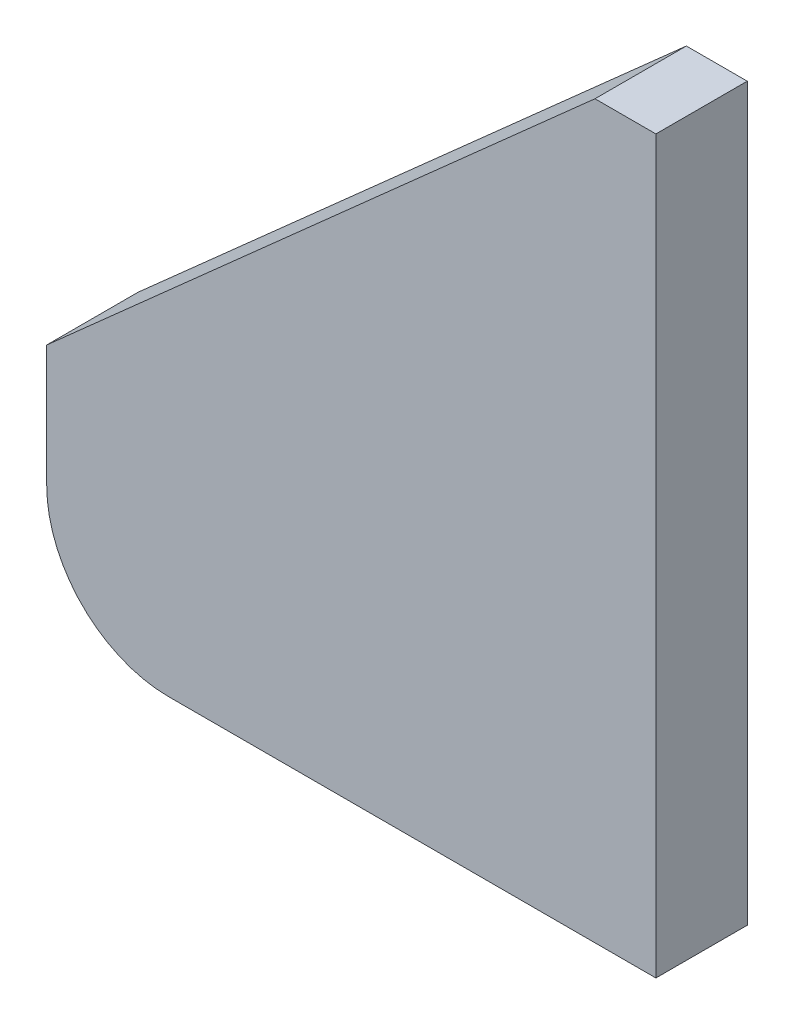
from build123d import *

# Parameters (mm, degrees)
BASE_EXTRUSION_DEPTH = 15


with BuildPart() as part:
    # Esquisse1 → Base-Extrusion (new body)
    with BuildSketch(Plane.XY):
        with BuildLine():
            Line((-10, 120), (-100, 40))
            Line((-100, 40), (-100, 20))
            ThreePointArc((-100, 20), (-94.142135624, 5.857864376), (-80, 0))
            Line((-80, 0), (0, 0))
            Line((0, 0), (0, 120))
            Line((0, 120), (-10, 120))
        make_face()
    extrude(amount=BASE_EXTRUSION_DEPTH)


solid = part.part
